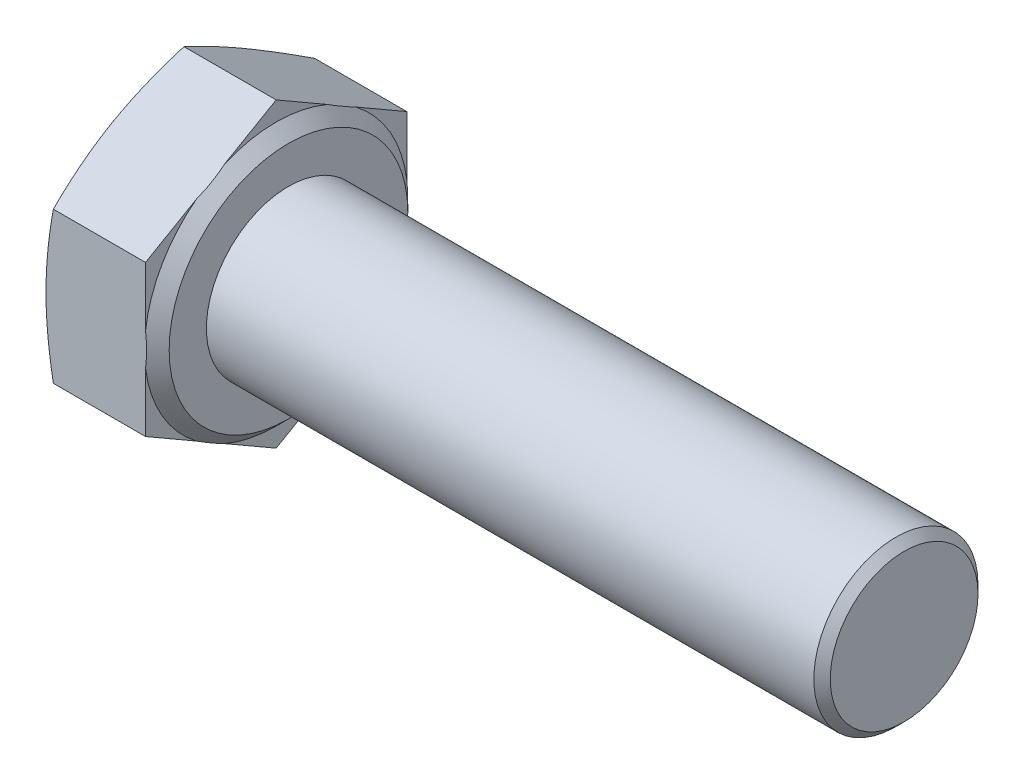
ISO-10303-21;
HEADER;
FILE_DESCRIPTION(('STEP AP214'),'2;1');
FILE_NAME('part.step','',(''),(''),'','','');
FILE_SCHEMA(('AUTOMOTIVE_DESIGN { 1 0 10303 214 1 1 1 1 }'));
ENDSEC;
DATA;
#1=APPLICATION_CONTEXT('core data for automotive mechanical design processes');
#2=APPLICATION_PROTOCOL_DEFINITION('international standard','automotive_design',2000,#1);
#3=PRODUCT_CONTEXT('',#1,'mechanical');
#4=PRODUCT('Part','Part','',(#3));
#5=PRODUCT_RELATED_PRODUCT_CATEGORY('part','',(#4));
#6=PRODUCT_DEFINITION_FORMATION('','',#4);
#7=PRODUCT_DEFINITION_CONTEXT('part definition',#1,'design');
#8=PRODUCT_DEFINITION('design','',#6,#7);
#9=PRODUCT_DEFINITION_SHAPE('','',#8);
#10=(LENGTH_UNIT() NAMED_UNIT(*) SI_UNIT(.MILLI.,.METRE.));
#11=(NAMED_UNIT(*) PLANE_ANGLE_UNIT() SI_UNIT($,.RADIAN.));
#12=(NAMED_UNIT(*) SI_UNIT($,.STERADIAN.) SOLID_ANGLE_UNIT());
#13=UNCERTAINTY_MEASURE_WITH_UNIT(LENGTH_MEASURE(1.E-05),#10,'distance_accuracy_value','');
#14=(GEOMETRIC_REPRESENTATION_CONTEXT(3) GLOBAL_UNCERTAINTY_ASSIGNED_CONTEXT((#13)) GLOBAL_UNIT_ASSIGNED_CONTEXT((#10,
#11,#12)) REPRESENTATION_CONTEXT('',''));
#15=CARTESIAN_POINT('',(0.,0.,0.));
#16=DIRECTION('',(0.,0.,1.));
#17=DIRECTION('',(1.,0.,0.));
#18=AXIS2_PLACEMENT_3D('',#15,#16,#17);
#19=CARTESIAN_POINT('',(5.45,-3.67483446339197,-6.365));
#20=DIRECTION('',(1.,0.,0.));
#21=DIRECTION('',(0.,0.,-1.));
#22=AXIS2_PLACEMENT_3D('',#19,#20,#21);
#23=PLANE('',#22);
#24=CARTESIAN_POINT('',(5.45,0.,0.));
#25=DIRECTION('',(-1.,0.,0.));
#26=DIRECTION('',(0.,0.,1.));
#27=AXIS2_PLACEMENT_3D('',#24,#25,#26);
#28=CIRCLE('',#27,5.815);
#29=CARTESIAN_POINT('',(5.45,0.,5.815));
#30=VERTEX_POINT('',#29);
#31=EDGE_CURVE('E344',#30,#30,#28,.T.);
#32=ORIENTED_EDGE('',*,*,#31,.F.);
#33=EDGE_LOOP('',(#32));
#34=FACE_BOUND('',#33,.T.);
#35=CARTESIAN_POINT('',(5.45,0.,0.));
#36=DIRECTION('',(1.,0.,0.));
#37=DIRECTION('',(0.,0.,-1.));
#38=AXIS2_PLACEMENT_3D('',#35,#36,#37);
#39=CIRCLE('',#38,4.);
#40=CARTESIAN_POINT('',(5.45,0.,-4.));
#41=VERTEX_POINT('',#40);
#42=EDGE_CURVE('E347',#41,#41,#39,.T.);
#43=ORIENTED_EDGE('',*,*,#42,.F.);
#44=EDGE_LOOP('',(#43));
#45=FACE_BOUND('',#44,.T.);
#46=ADVANCED_FACE('F32',(#34,#45),#23,.T.);
#47=CARTESIAN_POINT('',(5.45,-7.34966892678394,0.));
#48=DIRECTION('',(0.,0.866025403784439,0.5));
#49=DIRECTION('',(0.,-0.5,0.866025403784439));
#50=AXIS2_PLACEMENT_3D('',#47,#48,#49);
#51=PLANE('',#50);
#52=CARTESIAN_POINT('',(0.358432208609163,-3.67471899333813,-6.3652));
#53=CARTESIAN_POINT('',(0.303017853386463,-3.82691148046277,-6.10159487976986));
#54=CARTESIAN_POINT('',(0.252608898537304,-3.9796058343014,-5.83712050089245));
#55=CARTESIAN_POINT('',(0.163922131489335,-4.28598738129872,-5.30645209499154));
#56=CARTESIAN_POINT('',(0.125653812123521,-4.43967525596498,-5.0402568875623));
#57=CARTESIAN_POINT('',(0.0637558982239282,-4.74633825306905,-4.50910099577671));
#58=CARTESIAN_POINT('',(0.0399912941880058,-4.8993063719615,-4.24415244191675));
#59=CARTESIAN_POINT('',(0.00811628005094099,-5.2056003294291,-3.71363574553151));
#60=CARTESIAN_POINT('',(0.,-5.35892601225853,-3.44806787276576));
#61=CARTESIAN_POINT('',(0.,-5.66557737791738,-2.91693212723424));
#62=CARTESIAN_POINT('',(0.00811628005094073,-5.81890306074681,-2.65136425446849));
#63=CARTESIAN_POINT('',(0.0399912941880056,-6.12519701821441,-2.12084755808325));
#64=CARTESIAN_POINT('',(0.0637558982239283,-6.27816513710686,-1.85589900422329));
#65=CARTESIAN_POINT('',(0.125653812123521,-6.58482813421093,-1.3247431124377));
#66=CARTESIAN_POINT('',(0.163922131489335,-6.73851600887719,-1.05854790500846));
#67=CARTESIAN_POINT('',(0.252608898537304,-7.04489755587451,-0.527879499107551));
#68=CARTESIAN_POINT('',(0.303017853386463,-7.19759190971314,-0.263405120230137));
#69=CARTESIAN_POINT('',(0.358432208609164,-7.34978439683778,0.000200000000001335));
#70=B_SPLINE_CURVE_WITH_KNOTS('',3,(#52,#53,#54,#55,#56,#57,#58,#59,#60,#61,#62,#63,#64,#65,#66,
#67,#68,#69),.UNSPECIFIED.,.F.,.F.,(4,2,2,2,2,2,2,2,4),(0.,0.928259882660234,1.85724379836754,
2.77744274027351,3.69729643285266,4.6171501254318,5.53734906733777,6.46633298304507,
7.39459286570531),.UNSPECIFIED.);
#71=CARTESIAN_POINT('',(0.358390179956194,-3.67483446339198,-6.365));
#72=VERTEX_POINT('',#71);
#73=CARTESIAN_POINT('',(0.,-5.51225169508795,-3.1825));
#74=VERTEX_POINT('',#73);
#75=EDGE_CURVE('E146',#72,#74,#70,.T.);
#76=ORIENTED_EDGE('',*,*,#75,.F.);
#77=DIRECTION('',(-1.,0.,0.));
#78=VECTOR('',#77,1.);
#79=CARTESIAN_POINT('',(5.45,-3.67483446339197,-6.365));
#80=LINE('',#79,#78);
#81=CARTESIAN_POINT('',(4.85,-3.67483446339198,-6.365));
#82=VERTEX_POINT('',#81);
#83=EDGE_CURVE('E175',#82,#72,#80,.T.);
#84=ORIENTED_EDGE('',*,*,#83,.F.);
#85=DIRECTION('',(0.,0.5,-0.866025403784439));
#86=VECTOR('',#85,1.);
#87=CARTESIAN_POINT('',(4.85,-7.34966892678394,0.));
#88=LINE('',#87,#86);
#89=CARTESIAN_POINT('',(4.85,-5.11256431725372,-3.87477884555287));
#90=VERTEX_POINT('',#89);
#91=EDGE_CURVE('E384',#90,#82,#88,.T.);
#92=ORIENTED_EDGE('',*,*,#91,.F.);
#93=CARTESIAN_POINT('',(4.8498,-5.91274078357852,-2.48883255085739));
#94=CARTESIAN_POINT('',(4.86645104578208,-5.84620990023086,-2.60406742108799));
#95=CARTESIAN_POINT('',(4.8790176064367,-5.77941769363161,-2.71975491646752));
#96=CARTESIAN_POINT('',(4.8957758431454,-5.64583354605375,-2.95112944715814));
#97=CARTESIAN_POINT('',(4.9,-5.57904262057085,-3.06681472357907));
#98=CARTESIAN_POINT('',(4.9,-5.44546076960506,-3.29818527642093));
#99=CARTESIAN_POINT('',(4.8957758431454,-5.37866984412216,-3.41387055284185));
#100=CARTESIAN_POINT('',(4.8790176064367,-5.2450856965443,-3.64524508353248));
#101=CARTESIAN_POINT('',(4.86645104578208,-5.17829348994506,-3.76093257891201));
#102=CARTESIAN_POINT('',(4.8498,-5.11176260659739,-3.87616744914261));
#103=B_SPLINE_CURVE_WITH_KNOTS('',3,(#93,#94,#95,#96,#97,#98,#99,#100,#101,#102),.UNSPECIFIED.,
.F.,.F.,(4,2,2,2,4),(0.,0.402253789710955,0.802938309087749,1.20362282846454,1.6058766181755),.UNSPECIFIED.);
#104=CARTESIAN_POINT('',(4.85,-5.91193907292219,-2.49022115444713));
#105=VERTEX_POINT('',#104);
#106=EDGE_CURVE('E281',#105,#90,#103,.T.);
#107=ORIENTED_EDGE('',*,*,#106,.F.);
#108=CARTESIAN_POINT('',(4.85,-7.34966892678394,0.));
#109=VERTEX_POINT('',#108);
#110=EDGE_CURVE('E389',#109,#105,#88,.T.);
#111=ORIENTED_EDGE('',*,*,#110,.F.);
#112=DIRECTION('',(-1.,0.,0.));
#113=VECTOR('',#112,1.);
#114=CARTESIAN_POINT('',(5.45,-7.34966892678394,0.));
#115=LINE('',#114,#113);
#116=CARTESIAN_POINT('',(0.358390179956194,-7.34966892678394,0.));
#117=VERTEX_POINT('',#116);
#118=EDGE_CURVE('E169',#109,#117,#115,.T.);
#119=ORIENTED_EDGE('',*,*,#118,.T.);
#120=EDGE_CURVE('E200',#74,#117,#70,.T.);
#121=ORIENTED_EDGE('',*,*,#120,.F.);
#122=EDGE_LOOP('',(#76,#84,#92,#107,#111,#119,#121));
#123=FACE_BOUND('',#122,.T.);
#124=ADVANCED_FACE('F215',(#123),#51,.F.);
#125=CARTESIAN_POINT('',(5.45,-3.67483446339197,-6.365));
#126=DIRECTION('',(0.,0.,1.));
#127=DIRECTION('',(0.,-1.,0.));
#128=AXIS2_PLACEMENT_3D('',#125,#126,#127);
#129=PLANE('',#128);
#130=CARTESIAN_POINT('',(1.9150953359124,-9.72967062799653,-6.365));
#131=CARTESIAN_POINT('',(1.82740685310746,-9.44169496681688,-6.365));
#132=CARTESIAN_POINT('',(1.74074158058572,-9.15340194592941,-6.365));
#133=CARTESIAN_POINT('',(1.57002349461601,-8.57601961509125,-6.365));
#134=CARTESIAN_POINT('',(1.48597088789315,-8.28693024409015,-6.365));
#135=CARTESIAN_POINT('',(1.320904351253,-7.70729883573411,-6.365));
#136=CARTESIAN_POINT('',(1.23989638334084,-7.41675509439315,-6.365));
#137=CARTESIAN_POINT('',(1.08186750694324,-6.83458682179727,-6.365));
#138=CARTESIAN_POINT('',(1.0048465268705,-6.54296231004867,-6.365));
#139=CARTESIAN_POINT('',(0.856698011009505,-5.96204179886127,-6.365));
#140=CARTESIAN_POINT('',(0.785509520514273,-5.67276142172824,-6.365));
#141=CARTESIAN_POINT('',(0.64919338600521,-5.09276117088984,-6.365));
#142=CARTESIAN_POINT('',(0.584065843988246,-4.80204127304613,-6.365));
#143=CARTESIAN_POINT('',(0.46138999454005,-4.21909692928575,-6.365));
#144=CARTESIAN_POINT('',(0.40383910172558,-3.92687303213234,-6.365));
#145=CARTESIAN_POINT('',(0.298068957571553,-3.34072867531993,-6.365));
#146=CARTESIAN_POINT('',(0.249849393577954,-3.04680827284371,-6.365));
#147=CARTESIAN_POINT('',(0.169475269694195,-2.49036754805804,-6.365));
#148=CARTESIAN_POINT('',(0.136125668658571,-2.22802146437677,-6.365));
#149=CARTESIAN_POINT('',(0.0796727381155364,-1.70221996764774,-6.365));
#150=CARTESIAN_POINT('',(0.0565691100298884,-1.43876458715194,-6.365));
#151=CARTESIAN_POINT('',(0.0217207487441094,-0.911278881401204,-6.365));
#152=CARTESIAN_POINT('',(0.00996798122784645,-0.64724909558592,-6.365));
#153=CARTESIAN_POINT('',(-0.00158361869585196,-0.11892536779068,-6.365));
#154=CARTESIAN_POINT('',(-0.00138253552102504,0.145368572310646,-6.365));
#155=CARTESIAN_POINT('',(0.0109939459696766,0.675012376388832,-6.365));
#156=CARTESIAN_POINT('',(0.0232300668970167,0.940360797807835,-6.365));
#157=CARTESIAN_POINT('',(0.0591135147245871,1.47027824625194,-6.365));
#158=CARTESIAN_POINT('',(0.0827611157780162,1.73484725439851,-6.365));
#159=CARTESIAN_POINT('',(0.14036130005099,2.26307523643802,-6.365));
#160=CARTESIAN_POINT('',(0.174322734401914,2.52673323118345,-6.365));
#161=CARTESIAN_POINT('',(0.251173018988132,3.0527302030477,-6.365));
#162=CARTESIAN_POINT('',(0.294061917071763,3.31506917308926,-6.365));
#163=CARTESIAN_POINT('',(0.389839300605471,3.85223310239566,-6.365));
#164=CARTESIAN_POINT('',(0.443136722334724,4.12698449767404,-6.365));
#165=CARTESIAN_POINT('',(0.556591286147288,4.67507636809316,-6.365));
#166=CARTESIAN_POINT('',(0.616748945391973,4.94841673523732,-6.365));
#167=CARTESIAN_POINT('',(0.742660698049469,5.49388136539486,-6.365));
#168=CARTESIAN_POINT('',(0.808416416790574,5.7660052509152,-6.365));
#169=CARTESIAN_POINT('',(0.944454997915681,6.30910658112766,-6.365));
#170=CARTESIAN_POINT('',(1.01473775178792,6.58008405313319,-6.365));
#171=CARTESIAN_POINT('',(1.15907513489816,7.1214003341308,-6.365));
#172=CARTESIAN_POINT('',(1.23313447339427,7.39173788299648,-6.365));
#173=CARTESIAN_POINT('',(1.38427063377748,7.93156975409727,-6.365));
#174=CARTESIAN_POINT('',(1.46134750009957,8.20106406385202,-6.365));
#175=CARTESIAN_POINT('',(1.69623888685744,9.00837522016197,-6.365));
#176=CARTESIAN_POINT('',(1.85774082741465,9.5451184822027,-6.365));
#177=CARTESIAN_POINT('',(2.18566531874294,10.6106004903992,-6.365));
#178=CARTESIAN_POINT('',(2.35201388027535,11.1393621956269,-6.365));
#179=CARTESIAN_POINT('',(2.68943698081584,12.1954003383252,-6.365));
#180=CARTESIAN_POINT('',(2.86051174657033,12.7226767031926,-6.365));
#181=CARTESIAN_POINT('',(3.20545948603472,13.7740950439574,-6.365));
#182=CARTESIAN_POINT('',(3.37931937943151,14.298241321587,-6.365));
#183=CARTESIAN_POINT('',(3.64203864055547,15.0837906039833,-6.365));
#184=CARTESIAN_POINT('',(3.72992971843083,15.3455181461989,-6.365));
#185=CARTESIAN_POINT('',(3.90628058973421,15.8687808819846,-6.365));
#186=CARTESIAN_POINT('',(3.99474038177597,16.1303160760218,-6.365));
#187=CARTESIAN_POINT('',(4.08344640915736,16.3917677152,-6.365));
#188=B_SPLINE_CURVE_WITH_KNOTS('',3,(#130,#131,#132,#133,#134,#135,#136,#137,#138,#139,#140,
#141,#142,#143,#144,#145,#146,#147,#148,#149,#150,#151,#152,#153,#154,#155,#156,#157,#158,#159,
#160,#161,#162,#163,#164,#165,#166,#167,#168,#169,#170,#171,#172,#173,#174,#175,#176,#177,#178,
#179,#180,#181,#182,#183,#184,#185,#186,#187),.UNSPECIFIED.,.F.,.F.,(4,2,2,2,2,2,2,2,2,2,2,2,2,
2,2,2,2,2,2,2,2,2,2,2,2,2,2,2,4),(0.,0.903097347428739,1.8062659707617,2.7111196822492,
3.61595714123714,4.50963841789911,5.4033347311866,6.29672529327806,7.19008591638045,
7.98328363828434,8.77645824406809,9.56907101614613,10.361678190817,11.1583050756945,
11.9549510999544,12.7522827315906,13.5496186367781,14.3891305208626,15.2287057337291,
16.0685255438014,16.9083252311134,17.7491990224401,18.5900852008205,20.271552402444,
21.9344598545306,23.5974472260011,25.2541246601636,26.0823966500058,26.9106666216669),.UNSPECIFIED.);
#189=CARTESIAN_POINT('',(0.358390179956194,3.67483446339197,-6.36500000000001));
#190=VERTEX_POINT('',#189);
#191=CARTESIAN_POINT('',(0.,0.,-6.365));
#192=VERTEX_POINT('',#191);
#193=EDGE_CURVE('E260',#190,#192,#188,.F.);
#194=ORIENTED_EDGE('',*,*,#193,.F.);
#195=DIRECTION('',(-1.,0.,0.));
#196=VECTOR('',#195,1.);
#197=CARTESIAN_POINT('',(5.45,3.67483446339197,-6.365));
#198=LINE('',#197,#196);
#199=CARTESIAN_POINT('',(4.85,3.67483446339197,-6.365));
#200=VERTEX_POINT('',#199);
#201=EDGE_CURVE('E166',#200,#190,#198,.T.);
#202=ORIENTED_EDGE('',*,*,#201,.F.);
#203=DIRECTION('',(0.,1.,0.));
#204=VECTOR('',#203,1.);
#205=CARTESIAN_POINT('',(4.85,-3.67483446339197,-6.365));
#206=LINE('',#205,#204);
#207=CARTESIAN_POINT('',(4.85,0.7993747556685,-6.365));
#208=VERTEX_POINT('',#207);
#209=EDGE_CURVE('E390',#208,#200,#206,.T.);
#210=ORIENTED_EDGE('',*,*,#209,.F.);
#211=CARTESIAN_POINT('',(4.03279951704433,-3.43387519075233,-6.365));
#212=CARTESIAN_POINT('',(4.12915263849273,-3.23085023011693,-6.365));
#213=CARTESIAN_POINT('',(4.22025748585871,-3.02511909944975,-6.365));
#214=CARTESIAN_POINT('',(4.38924442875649,-2.607586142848,-6.365));
#215=CARTESIAN_POINT('',(4.46708471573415,-2.39576749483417,-6.365));
#216=CARTESIAN_POINT('',(4.60570873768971,-1.96811964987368,-6.365));
#217=CARTESIAN_POINT('',(4.66660505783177,-1.75232760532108,-6.365));
#218=CARTESIAN_POINT('',(4.76875528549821,-1.31633465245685,-6.365));
#219=CARTESIAN_POINT('',(4.81003455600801,-1.09613982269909,-6.365));
#220=CARTESIAN_POINT('',(4.86166598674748,-0.716857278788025,-6.365));
#221=CARTESIAN_POINT('',(4.87750915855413,-0.558507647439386,-6.365));
#222=CARTESIAN_POINT('',(4.89740688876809,-0.241033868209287,-6.365));
#223=CARTESIAN_POINT('',(4.90146005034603,-0.0819096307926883,-6.365));
#224=CARTESIAN_POINT('',(4.89760366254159,0.236307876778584,-6.365));
#225=CARTESIAN_POINT('',(4.8896854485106,0.395401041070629,-6.365));
#226=CARTESIAN_POINT('',(4.86219166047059,0.712536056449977,-6.365));
#227=CARTESIAN_POINT('',(4.84261749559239,0.870578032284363,-6.365));
#228=CARTESIAN_POINT('',(4.77989629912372,1.26397857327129,-6.365));
#229=CARTESIAN_POINT('',(4.72984501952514,1.49825109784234,-6.365));
#230=CARTESIAN_POINT('',(4.60840439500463,1.96142866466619,-6.365));
#231=CARTESIAN_POINT('',(4.53698240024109,2.19032491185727,-6.365));
#232=CARTESIAN_POINT('',(4.37639278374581,2.64284924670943,-6.365));
#233=CARTESIAN_POINT('',(4.28714977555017,2.86645027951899,-6.365));
#234=CARTESIAN_POINT('',(4.14298757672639,3.1968115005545,-6.365));
#235=CARTESIAN_POINT('',(4.09331043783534,3.30591051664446,-6.365));
#236=CARTESIAN_POINT('',(3.99087238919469,3.52261302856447,-6.365));
#237=CARTESIAN_POINT('',(3.93811240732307,3.63021696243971,-6.365));
#238=CARTESIAN_POINT('',(3.88398571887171,3.73713082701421,-6.365));
#239=B_SPLINE_CURVE_WITH_KNOTS('',3,(#211,#212,#213,#214,#215,#216,#217,#218,#219,#220,#221,
#222,#223,#224,#225,#226,#227,#228,#229,#230,#231,#232,#233,#234,#235,#236,#237,#238),
.UNSPECIFIED.,.F.,.F.,(4,2,2,2,2,2,2,2,2,2,2,2,2,4),(0.,0.67440515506,1.35089815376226,
2.02278254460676,2.69379587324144,3.17081389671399,3.64788843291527,4.1253084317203,
4.60267072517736,5.32008921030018,6.03860940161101,6.76023604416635,7.11982798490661,
7.47931224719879),.UNSPECIFIED.);
#240=CARTESIAN_POINT('',(4.85,-0.799374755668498,-6.365));
#241=VERTEX_POINT('',#240);
#242=EDGE_CURVE('E275',#241,#208,#239,.T.);
#243=ORIENTED_EDGE('',*,*,#242,.F.);
#244=EDGE_CURVE('E386',#82,#241,#206,.T.);
#245=ORIENTED_EDGE('',*,*,#244,.F.);
#246=ORIENTED_EDGE('',*,*,#83,.T.);
#247=EDGE_CURVE('E157',#192,#72,#188,.F.);
#248=ORIENTED_EDGE('',*,*,#247,.F.);
#249=EDGE_LOOP('',(#194,#202,#210,#243,#245,#246,#248));
#250=FACE_BOUND('',#249,.T.);
#251=ADVANCED_FACE('F267',(#250),#129,.F.);
#252=CARTESIAN_POINT('',(5.45,3.67483446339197,-6.365));
#253=DIRECTION('',(0.,-0.866025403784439,0.5));
#254=DIRECTION('',(0.,-0.5,-0.866025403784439));
#255=AXIS2_PLACEMENT_3D('',#252,#253,#254);
#256=PLANE('',#255);
#257=CARTESIAN_POINT('',(0.358432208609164,7.34978439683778,0.000200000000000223));
#258=CARTESIAN_POINT('',(0.303017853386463,7.19759190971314,-0.263405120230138));
#259=CARTESIAN_POINT('',(0.252608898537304,7.04489755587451,-0.527879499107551));
#260=CARTESIAN_POINT('',(0.163922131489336,6.73851600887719,-1.05854790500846));
#261=CARTESIAN_POINT('',(0.125653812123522,6.58482813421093,-1.3247431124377));
#262=CARTESIAN_POINT('',(0.0637558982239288,6.27816513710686,-1.85589900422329));
#263=CARTESIAN_POINT('',(0.0399912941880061,6.12519701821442,-2.12084755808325));
#264=CARTESIAN_POINT('',(0.00811628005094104,5.81890306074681,-2.65136425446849));
#265=CARTESIAN_POINT('',(0.,5.66557737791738,-2.91693212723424));
#266=CARTESIAN_POINT('',(0.,5.35892601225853,-3.44806787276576));
#267=CARTESIAN_POINT('',(0.00811628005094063,5.2056003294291,-3.71363574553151));
#268=CARTESIAN_POINT('',(0.0399912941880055,4.8993063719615,-4.24415244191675));
#269=CARTESIAN_POINT('',(0.0637558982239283,4.74633825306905,-4.50910099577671));
#270=CARTESIAN_POINT('',(0.125653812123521,4.43967525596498,-5.0402568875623));
#271=CARTESIAN_POINT('',(0.163922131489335,4.28598738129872,-5.30645209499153));
#272=CARTESIAN_POINT('',(0.252608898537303,3.9796058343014,-5.83712050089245));
#273=CARTESIAN_POINT('',(0.303017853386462,3.82691148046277,-6.10159487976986));
#274=CARTESIAN_POINT('',(0.358432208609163,3.67471899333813,-6.3652));
#275=B_SPLINE_CURVE_WITH_KNOTS('',3,(#257,#258,#259,#260,#261,#262,#263,#264,#265,#266,#267,
#268,#269,#270,#271,#272,#273,#274),.UNSPECIFIED.,.F.,.F.,(4,2,2,2,2,2,2,2,4),(0.,
0.928259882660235,1.85724379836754,2.77744274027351,3.69729643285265,4.6171501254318,
5.53734906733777,6.46633298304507,7.39459286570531),.UNSPECIFIED.);
#276=CARTESIAN_POINT('',(0.358390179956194,7.34966892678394,0.));
#277=VERTEX_POINT('',#276);
#278=CARTESIAN_POINT('',(0.,5.51225169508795,-3.1825));
#279=VERTEX_POINT('',#278);
#280=EDGE_CURVE('E47',#277,#279,#275,.T.);
#281=ORIENTED_EDGE('',*,*,#280,.F.);
#282=DIRECTION('',(-1.,0.,0.));
#283=VECTOR('',#282,1.);
#284=CARTESIAN_POINT('',(5.45,7.34966892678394,0.));
#285=LINE('',#284,#283);
#286=CARTESIAN_POINT('',(4.85,7.34966892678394,0.));
#287=VERTEX_POINT('',#286);
#288=EDGE_CURVE('E163',#287,#277,#285,.T.);
#289=ORIENTED_EDGE('',*,*,#288,.F.);
#290=DIRECTION('',(0.,0.5,0.866025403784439));
#291=VECTOR('',#290,1.);
#292=CARTESIAN_POINT('',(4.85,3.67483446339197,-6.365));
#293=LINE('',#292,#291);
#294=CARTESIAN_POINT('',(4.85,5.91193907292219,-2.49022115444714));
#295=VERTEX_POINT('',#294);
#296=EDGE_CURVE('E414',#295,#287,#293,.T.);
#297=ORIENTED_EDGE('',*,*,#296,.F.);
#298=CARTESIAN_POINT('',(4.8498,5.11176260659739,-3.87616744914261));
#299=CARTESIAN_POINT('',(4.86645104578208,5.17829348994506,-3.76093257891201));
#300=CARTESIAN_POINT('',(4.8790176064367,5.2450856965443,-3.64524508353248));
#301=CARTESIAN_POINT('',(4.8957758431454,5.37866984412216,-3.41387055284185));
#302=CARTESIAN_POINT('',(4.9,5.44546076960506,-3.29818527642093));
#303=CARTESIAN_POINT('',(4.9,5.57904262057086,-3.06681472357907));
#304=CARTESIAN_POINT('',(4.8957758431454,5.64583354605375,-2.95112944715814));
#305=CARTESIAN_POINT('',(4.8790176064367,5.77941769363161,-2.71975491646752));
#306=CARTESIAN_POINT('',(4.86645104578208,5.84620990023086,-2.60406742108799));
#307=CARTESIAN_POINT('',(4.8498,5.91274078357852,-2.48883255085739));
#308=B_SPLINE_CURVE_WITH_KNOTS('',3,(#298,#299,#300,#301,#302,#303,#304,#305,#306,#307),
.UNSPECIFIED.,.F.,.F.,(4,2,2,2,4),(0.,0.402253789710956,0.80293830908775,1.20362282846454,
1.6058766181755),.UNSPECIFIED.);
#309=CARTESIAN_POINT('',(4.85,5.11256431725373,-3.87477884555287));
#310=VERTEX_POINT('',#309);
#311=EDGE_CURVE('E282',#310,#295,#308,.T.);
#312=ORIENTED_EDGE('',*,*,#311,.F.);
#313=EDGE_CURVE('E409',#200,#310,#293,.T.);
#314=ORIENTED_EDGE('',*,*,#313,.F.);
#315=ORIENTED_EDGE('',*,*,#201,.T.);
#316=EDGE_CURVE('E261',#279,#190,#275,.T.);
#317=ORIENTED_EDGE('',*,*,#316,.F.);
#318=EDGE_LOOP('',(#281,#289,#297,#312,#314,#315,#317));
#319=FACE_BOUND('',#318,.T.);
#320=ADVANCED_FACE('F270',(#319),#256,.F.);
#321=CARTESIAN_POINT('',(5.45,7.34966892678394,0.));
#322=DIRECTION('',(0.,-0.866025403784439,-0.5));
#323=DIRECTION('',(0.,0.5,-0.866025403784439));
#324=AXIS2_PLACEMENT_3D('',#321,#322,#323);
#325=PLANE('',#324);
#326=CARTESIAN_POINT('',(0.358432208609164,3.67471899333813,6.3652));
#327=CARTESIAN_POINT('',(0.303017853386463,3.82691148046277,6.10159487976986));
#328=CARTESIAN_POINT('',(0.252608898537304,3.9796058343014,5.83712050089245));
#329=CARTESIAN_POINT('',(0.163922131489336,4.28598738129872,5.30645209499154));
#330=CARTESIAN_POINT('',(0.125653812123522,4.43967525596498,5.0402568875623));
#331=CARTESIAN_POINT('',(0.0637558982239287,4.74633825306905,4.50910099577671));
#332=CARTESIAN_POINT('',(0.0399912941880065,4.8993063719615,4.24415244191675));
#333=CARTESIAN_POINT('',(0.00811628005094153,5.2056003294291,3.71363574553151));
#334=CARTESIAN_POINT('',(0.,5.35892601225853,3.44806787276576));
#335=CARTESIAN_POINT('',(0.,5.66557737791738,2.91693212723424));
#336=CARTESIAN_POINT('',(0.0081162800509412,5.81890306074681,2.65136425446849));
#337=CARTESIAN_POINT('',(0.0399912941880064,6.12519701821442,2.12084755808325));
#338=CARTESIAN_POINT('',(0.0637558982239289,6.27816513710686,1.85589900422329));
#339=CARTESIAN_POINT('',(0.125653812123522,6.58482813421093,1.3247431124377));
#340=CARTESIAN_POINT('',(0.163922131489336,6.73851600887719,1.05854790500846));
#341=CARTESIAN_POINT('',(0.252608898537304,7.04489755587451,0.527879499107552));
#342=CARTESIAN_POINT('',(0.303017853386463,7.19759190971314,0.263405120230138));
#343=CARTESIAN_POINT('',(0.358432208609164,7.34978439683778,-0.00020000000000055));
#344=B_SPLINE_CURVE_WITH_KNOTS('',3,(#326,#327,#328,#329,#330,#331,#332,#333,#334,#335,#336,
#337,#338,#339,#340,#341,#342,#343),.UNSPECIFIED.,.F.,.F.,(4,2,2,2,2,2,2,2,4),(0.,
0.928259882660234,1.85724379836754,2.77744274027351,3.69729643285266,4.6171501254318,
5.53734906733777,6.46633298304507,7.39459286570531),.UNSPECIFIED.);
#345=CARTESIAN_POINT('',(0.358390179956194,3.67483446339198,6.365));
#346=VERTEX_POINT('',#345);
#347=CARTESIAN_POINT('',(0.,5.51225169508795,3.1825));
#348=VERTEX_POINT('',#347);
#349=EDGE_CURVE('E55',#346,#348,#344,.T.);
#350=ORIENTED_EDGE('',*,*,#349,.F.);
#351=DIRECTION('',(-1.,0.,0.));
#352=VECTOR('',#351,1.);
#353=CARTESIAN_POINT('',(5.45,3.67483446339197,6.365));
#354=LINE('',#353,#352);
#355=CARTESIAN_POINT('',(4.85,3.67483446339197,6.365));
#356=VERTEX_POINT('',#355);
#357=EDGE_CURVE('E154',#356,#346,#354,.T.);
#358=ORIENTED_EDGE('',*,*,#357,.F.);
#359=DIRECTION('',(0.,-0.5,0.866025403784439));
#360=VECTOR('',#359,1.);
#361=CARTESIAN_POINT('',(4.85,7.34966892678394,0.));
#362=LINE('',#361,#360);
#363=CARTESIAN_POINT('',(4.85,5.11256431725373,3.87477884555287));
#364=VERTEX_POINT('',#363);
#365=EDGE_CURVE('E421',#364,#356,#362,.T.);
#366=ORIENTED_EDGE('',*,*,#365,.F.);
#367=CARTESIAN_POINT('',(4.8498,5.91274078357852,2.48883255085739));
#368=CARTESIAN_POINT('',(4.86645104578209,5.84620990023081,2.60406742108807));
#369=CARTESIAN_POINT('',(4.87901760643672,5.77941769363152,2.71975491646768));
#370=CARTESIAN_POINT('',(4.89577584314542,5.64583354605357,2.95112944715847));
#371=CARTESIAN_POINT('',(4.90000000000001,5.57904262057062,3.06681472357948));
#372=CARTESIAN_POINT('',(4.89999999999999,5.44546076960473,3.29818527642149));
#373=CARTESIAN_POINT('',(4.89577584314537,5.37866984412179,3.4138705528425));
#374=CARTESIAN_POINT('',(4.87901760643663,5.24508569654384,3.64524508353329));
#375=CARTESIAN_POINT('',(4.86645104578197,5.17829348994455,3.7609325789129));
#376=CARTESIAN_POINT('',(4.84979999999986,5.11176260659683,3.87616744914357));
#377=B_SPLINE_CURVE_WITH_KNOTS('',3,(#367,#368,#369,#370,#371,#372,#373,#374,#375,#376),
.UNSPECIFIED.,.F.,.F.,(4,2,2,2,4),(0.,0.402253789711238,0.802938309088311,1.20362282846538,
1.60587661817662),.UNSPECIFIED.);
#378=CARTESIAN_POINT('',(4.85,5.91193907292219,2.49022115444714));
#379=VERTEX_POINT('',#378);
#380=EDGE_CURVE('E314',#379,#364,#377,.T.);
#381=ORIENTED_EDGE('',*,*,#380,.F.);
#382=EDGE_CURVE('E420',#287,#379,#362,.T.);
#383=ORIENTED_EDGE('',*,*,#382,.F.);
#384=ORIENTED_EDGE('',*,*,#288,.T.);
#385=EDGE_CURVE('E156',#348,#277,#344,.T.);
#386=ORIENTED_EDGE('',*,*,#385,.F.);
#387=EDGE_LOOP('',(#350,#358,#366,#381,#383,#384,#386));
#388=FACE_BOUND('',#387,.T.);
#389=ADVANCED_FACE('F152',(#388),#325,.F.);
#390=CARTESIAN_POINT('',(5.45,3.67483446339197,6.365));
#391=DIRECTION('',(0.,0.,-1.));
#392=DIRECTION('',(-1.,0.,0.));
#393=AXIS2_PLACEMENT_3D('',#390,#391,#392);
#394=PLANE('',#393);
#395=CARTESIAN_POINT('',(1.91509499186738,-9.72966949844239,6.365));
#396=CARTESIAN_POINT('',(1.8274065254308,-9.44169388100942,6.365));
#397=CARTESIAN_POINT('',(1.74074126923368,-9.15340090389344,6.365));
#398=CARTESIAN_POINT('',(1.57002321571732,-8.57601866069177,6.365));
#399=CARTESIAN_POINT('',(1.48597062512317,-8.28692933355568,6.365));
#400=CARTESIAN_POINT('',(1.32090412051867,-7.70729801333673,6.365));
#401=CARTESIAN_POINT('',(1.23989616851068,-7.41675431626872,6.365));
#402=CARTESIAN_POINT('',(1.08186732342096,-6.83458613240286,6.365));
#403=CARTESIAN_POINT('',(1.00484635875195,-6.54296166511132,6.365));
#404=CARTESIAN_POINT('',(0.856697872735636,-5.96204124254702,6.365));
#405=CARTESIAN_POINT('',(0.785509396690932,-5.67276090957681,6.365));
#406=CARTESIAN_POINT('',(0.64919328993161,-5.09276074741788,6.365));
#407=CARTESIAN_POINT('',(0.584065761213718,-4.80204089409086,6.365));
#408=CARTESIAN_POINT('',(0.461389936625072,-4.21909663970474,6.365));
#409=CARTESIAN_POINT('',(0.403839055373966,-3.92687278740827,6.365));
#410=CARTESIAN_POINT('',(0.2980689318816,-3.34072852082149,6.365));
#411=CARTESIAN_POINT('',(0.249849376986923,-3.04680816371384,6.365));
#412=CARTESIAN_POINT('',(0.169475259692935,-2.49036747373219,6.365));
#413=CARTESIAN_POINT('',(0.136125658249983,-2.22802137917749,6.365));
#414=CARTESIAN_POINT('',(0.0796727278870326,-1.7022198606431,6.365));
#415=CARTESIAN_POINT('',(0.0565691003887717,-1.43876446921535,6.365));
#416=CARTESIAN_POINT('',(0.021720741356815,-0.911278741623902,6.365));
#417=CARTESIAN_POINT('',(0.00996797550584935,-0.647248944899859,6.365));
#418=CARTESIAN_POINT('',(-0.00158362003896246,-0.118925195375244,6.365));
#419=CARTESIAN_POINT('',(-0.00138253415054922,0.145368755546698,6.365));
#420=CARTESIAN_POINT('',(0.0109939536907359,0.675012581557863,6.365));
#421=CARTESIAN_POINT('',(0.0232300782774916,0.940361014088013,6.365));
#422=CARTESIAN_POINT('',(0.05911353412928,1.4702784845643,6.365));
#423=CARTESIAN_POINT('',(0.0827611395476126,1.7348475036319,6.365));
#424=CARTESIAN_POINT('',(0.140361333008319,2.26307550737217,6.365));
#425=CARTESIAN_POINT('',(0.174322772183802,2.52673351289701,6.365));
#426=CARTESIAN_POINT('',(0.251173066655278,3.05273050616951,6.365));
#427=CARTESIAN_POINT('',(0.294061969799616,3.3150694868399,6.365));
#428=CARTESIAN_POINT('',(0.389839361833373,3.85223342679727,6.365));
#429=CARTESIAN_POINT('',(0.443136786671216,4.1269848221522,6.365));
#430=CARTESIAN_POINT('',(0.556591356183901,4.6750766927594,6.365));
#431=CARTESIAN_POINT('',(0.616749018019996,4.94841706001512,6.365));
#432=CARTESIAN_POINT('',(0.742660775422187,5.49388169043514,6.365));
#433=CARTESIAN_POINT('',(0.808416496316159,5.76600557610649,6.365));
#434=CARTESIAN_POINT('',(0.944455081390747,6.30910690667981,6.365));
#435=CARTESIAN_POINT('',(1.01473783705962,6.58008437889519,6.365));
#436=CARTESIAN_POINT('',(1.15907522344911,7.12140066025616,6.365));
#437=CARTESIAN_POINT('',(1.23313456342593,7.39173820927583,6.365));
#438=CARTESIAN_POINT('',(1.38427072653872,7.93157008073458,6.365));
#439=CARTESIAN_POINT('',(1.46134759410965,8.20106439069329,6.365));
#440=CARTESIAN_POINT('',(1.6962389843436,9.00837554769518,6.365));
#441=CARTESIAN_POINT('',(1.85774092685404,9.54511881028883,6.365));
#442=CARTESIAN_POINT('',(2.18566542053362,10.6106008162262,6.365));
#443=CARTESIAN_POINT('',(2.35201398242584,11.1393625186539,6.365));
#444=CARTESIAN_POINT('',(2.6894370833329,12.1954006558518,6.365));
#445=CARTESIAN_POINT('',(2.86051184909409,12.7226770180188,6.365));
#446=CARTESIAN_POINT('',(3.2054595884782,13.7740953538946,6.365));
#447=CARTESIAN_POINT('',(3.37931948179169,14.2982416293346,6.365));
#448=CARTESIAN_POINT('',(3.64203874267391,15.0837909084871,6.365));
#449=CARTESIAN_POINT('',(3.72992982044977,15.3455184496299,6.365));
#450=CARTESIAN_POINT('',(3.90628069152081,15.8687811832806,6.365));
#451=CARTESIAN_POINT('',(3.99474048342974,16.1303163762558,6.365));
#452=CARTESIAN_POINT('',(4.08344651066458,16.3917680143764,6.365));
#453=B_SPLINE_CURVE_WITH_KNOTS('',3,(#395,#396,#397,#398,#399,#400,#401,#402,#403,#404,#405,
#406,#407,#408,#409,#410,#411,#412,#413,#414,#415,#416,#417,#418,#419,#420,#421,#422,#423,#424,
#425,#426,#427,#428,#429,#430,#431,#432,#433,#434,#435,#436,#437,#438,#439,#440,#441,#442,#443,
#444,#445,#446,#447,#448,#449,#450,#451,#452),.UNSPECIFIED.,.F.,.F.,(4,2,2,2,2,2,2,2,2,2,2,2,2,
2,2,2,2,2,2,2,2,2,2,2,2,2,2,2,4),(0.,0.903097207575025,1.80626569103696,2.71111926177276,
3.61595658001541,4.50963771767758,5.40333389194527,6.29672431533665,7.19008479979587,
7.98328255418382,8.77645719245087,9.56906999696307,10.3616772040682,11.1583041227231,
11.9549501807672,12.7522818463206,13.5496177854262,14.3891296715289,15.2287048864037,
16.0685246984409,16.9083243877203,17.7491981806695,18.5900843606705,20.2715515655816,
21.9344590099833,23.5974463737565,25.2541238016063,26.0823957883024,26.9106657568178),.UNSPECIFIED.);
#454=CARTESIAN_POINT('',(0.358390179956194,-3.67483446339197,6.36500000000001));
#455=VERTEX_POINT('',#454);
#456=CARTESIAN_POINT('',(0.,0.,6.365));
#457=VERTEX_POINT('',#456);
#458=EDGE_CURVE('E148',#455,#457,#453,.T.);
#459=ORIENTED_EDGE('',*,*,#458,.F.);
#460=DIRECTION('',(-1.,0.,0.));
#461=VECTOR('',#460,1.);
#462=CARTESIAN_POINT('',(5.45,-3.67483446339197,6.365));
#463=LINE('',#462,#461);
#464=CARTESIAN_POINT('',(4.85,-3.67483446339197,6.36500000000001));
#465=VERTEX_POINT('',#464);
#466=EDGE_CURVE('E164',#465,#455,#463,.T.);
#467=ORIENTED_EDGE('',*,*,#466,.F.);
#468=DIRECTION('',(0.,-1.,0.));
#469=VECTOR('',#468,1.);
#470=CARTESIAN_POINT('',(4.85,3.67483446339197,6.365));
#471=LINE('',#470,#469);
#472=CARTESIAN_POINT('',(4.85,-0.799374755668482,6.365));
#473=VERTEX_POINT('',#472);
#474=EDGE_CURVE('E361',#473,#465,#471,.T.);
#475=ORIENTED_EDGE('',*,*,#474,.F.);
#476=CARTESIAN_POINT('',(4.03279951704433,-3.43387519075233,6.365));
#477=CARTESIAN_POINT('',(4.12915263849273,-3.23085023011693,6.365));
#478=CARTESIAN_POINT('',(4.22025748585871,-3.02511909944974,6.365));
#479=CARTESIAN_POINT('',(4.38924442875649,-2.607586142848,6.365));
#480=CARTESIAN_POINT('',(4.46708471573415,-2.39576749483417,6.365));
#481=CARTESIAN_POINT('',(4.60570873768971,-1.96811964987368,6.365));
#482=CARTESIAN_POINT('',(4.66660505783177,-1.75232760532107,6.365));
#483=CARTESIAN_POINT('',(4.76875528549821,-1.31633465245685,6.365));
#484=CARTESIAN_POINT('',(4.81003455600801,-1.09613982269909,6.365));
#485=CARTESIAN_POINT('',(4.86166598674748,-0.716857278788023,6.365));
#486=CARTESIAN_POINT('',(4.87750915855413,-0.558507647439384,6.365));
#487=CARTESIAN_POINT('',(4.89740688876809,-0.241033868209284,6.365));
#488=CARTESIAN_POINT('',(4.90146005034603,-0.0819096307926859,6.365));
#489=CARTESIAN_POINT('',(4.89760366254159,0.236307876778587,6.365));
#490=CARTESIAN_POINT('',(4.8896854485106,0.395401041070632,6.365));
#491=CARTESIAN_POINT('',(4.86219166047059,0.712536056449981,6.365));
#492=CARTESIAN_POINT('',(4.84261749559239,0.870578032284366,6.365));
#493=CARTESIAN_POINT('',(4.77989629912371,1.26397857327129,6.365));
#494=CARTESIAN_POINT('',(4.72984501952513,1.49825109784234,6.365));
#495=CARTESIAN_POINT('',(4.60840439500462,1.9614286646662,6.365));
#496=CARTESIAN_POINT('',(4.53698240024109,2.19032491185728,6.365));
#497=CARTESIAN_POINT('',(4.37639278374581,2.64284924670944,6.365));
#498=CARTESIAN_POINT('',(4.28714977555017,2.866450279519,6.365));
#499=CARTESIAN_POINT('',(4.14298757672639,3.1968115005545,6.365));
#500=CARTESIAN_POINT('',(4.09331043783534,3.30591051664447,6.365));
#501=CARTESIAN_POINT('',(3.99087238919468,3.52261302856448,6.365));
#502=CARTESIAN_POINT('',(3.93811240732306,3.63021696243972,6.365));
#503=CARTESIAN_POINT('',(3.88398571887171,3.73713082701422,6.365));
#504=B_SPLINE_CURVE_WITH_KNOTS('',3,(#476,#477,#478,#479,#480,#481,#482,#483,#484,#485,#486,
#487,#488,#489,#490,#491,#492,#493,#494,#495,#496,#497,#498,#499,#500,#501,#502,#503),
.UNSPECIFIED.,.F.,.F.,(4,2,2,2,2,2,2,2,2,2,2,2,2,4),(0.,0.67440515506,1.35089815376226,
2.02278254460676,2.69379587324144,3.17081389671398,3.64788843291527,4.1253084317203,
4.60267072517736,5.32008921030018,6.03860940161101,6.76023604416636,7.11982798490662,
7.47931224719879),.UNSPECIFIED.);
#505=CARTESIAN_POINT('',(4.85,0.799374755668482,6.365));
#506=VERTEX_POINT('',#505);
#507=EDGE_CURVE('E309',#506,#473,#504,.F.);
#508=ORIENTED_EDGE('',*,*,#507,.F.);
#509=EDGE_CURVE('E162',#356,#506,#471,.T.);
#510=ORIENTED_EDGE('',*,*,#509,.F.);
#511=ORIENTED_EDGE('',*,*,#357,.T.);
#512=EDGE_CURVE('E138',#457,#346,#453,.T.);
#513=ORIENTED_EDGE('',*,*,#512,.F.);
#514=EDGE_LOOP('',(#459,#467,#475,#508,#510,#511,#513));
#515=FACE_BOUND('',#514,.T.);
#516=ADVANCED_FACE('F160',(#515),#394,.F.);
#517=CARTESIAN_POINT('',(5.45,-3.67483446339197,6.365));
#518=DIRECTION('',(0.,0.866025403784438,-0.5));
#519=DIRECTION('',(0.,0.5,0.866025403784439));
#520=AXIS2_PLACEMENT_3D('',#517,#518,#519);
#521=PLANE('',#520);
#522=CARTESIAN_POINT('',(0.358432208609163,-7.34978439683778,-0.00019999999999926));
#523=CARTESIAN_POINT('',(0.303017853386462,-7.19759190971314,0.263405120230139));
#524=CARTESIAN_POINT('',(0.252608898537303,-7.04489755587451,0.527879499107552));
#525=CARTESIAN_POINT('',(0.163922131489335,-6.73851600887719,1.05854790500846));
#526=CARTESIAN_POINT('',(0.125653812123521,-6.58482813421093,1.3247431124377));
#527=CARTESIAN_POINT('',(0.0637558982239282,-6.27816513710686,1.85589900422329));
#528=CARTESIAN_POINT('',(0.0399912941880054,-6.12519701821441,2.12084755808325));
#529=CARTESIAN_POINT('',(0.00811628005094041,-5.81890306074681,2.65136425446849));
#530=CARTESIAN_POINT('',(0.,-5.66557737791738,2.91693212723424));
#531=CARTESIAN_POINT('',(0.,-5.35892601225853,3.44806787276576));
#532=CARTESIAN_POINT('',(0.00811628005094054,-5.2056003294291,3.71363574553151));
#533=CARTESIAN_POINT('',(0.0399912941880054,-4.89930637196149,4.24415244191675));
#534=CARTESIAN_POINT('',(0.0637558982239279,-4.74633825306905,4.50910099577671));
#535=CARTESIAN_POINT('',(0.125653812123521,-4.43967525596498,5.0402568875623));
#536=CARTESIAN_POINT('',(0.163922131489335,-4.28598738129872,5.30645209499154));
#537=CARTESIAN_POINT('',(0.252608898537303,-3.9796058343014,5.83712050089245));
#538=CARTESIAN_POINT('',(0.303017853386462,-3.82691148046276,6.10159487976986));
#539=CARTESIAN_POINT('',(0.358432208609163,-3.67471899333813,6.3652));
#540=B_SPLINE_CURVE_WITH_KNOTS('',3,(#522,#523,#524,#525,#526,#527,#528,#529,#530,#531,#532,
#533,#534,#535,#536,#537,#538,#539),.UNSPECIFIED.,.F.,.F.,(4,2,2,2,2,2,2,2,4),(0.,
0.928259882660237,1.85724379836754,2.77744274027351,3.69729643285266,4.6171501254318,
5.53734906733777,6.46633298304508,7.39459286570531),.UNSPECIFIED.);
#541=CARTESIAN_POINT('',(0.,-5.51225169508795,3.1825));
#542=VERTEX_POINT('',#541);
#543=EDGE_CURVE('E202',#117,#542,#540,.T.);
#544=ORIENTED_EDGE('',*,*,#543,.F.);
#545=ORIENTED_EDGE('',*,*,#118,.F.);
#546=DIRECTION('',(0.,-0.5,-0.866025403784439));
#547=VECTOR('',#546,1.);
#548=CARTESIAN_POINT('',(4.85,-3.67483446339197,6.365));
#549=LINE('',#548,#547);
#550=CARTESIAN_POINT('',(4.85,-5.91193907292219,2.49022115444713));
#551=VERTEX_POINT('',#550);
#552=EDGE_CURVE('E178',#551,#109,#549,.T.);
#553=ORIENTED_EDGE('',*,*,#552,.F.);
#554=CARTESIAN_POINT('',(4.84979999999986,-5.11176260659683,3.87616744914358));
#555=CARTESIAN_POINT('',(4.86645104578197,-5.17829348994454,3.76093257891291));
#556=CARTESIAN_POINT('',(4.87901760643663,-5.24508569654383,3.64524508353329));
#557=CARTESIAN_POINT('',(4.89577584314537,-5.37866984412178,3.4138705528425));
#558=CARTESIAN_POINT('',(4.89999999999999,-5.44546076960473,3.2981852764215));
#559=CARTESIAN_POINT('',(4.90000000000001,-5.57904262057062,3.06681472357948));
#560=CARTESIAN_POINT('',(4.89577584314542,-5.64583354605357,2.95112944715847));
#561=CARTESIAN_POINT('',(4.87901760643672,-5.77941769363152,2.71975491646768));
#562=CARTESIAN_POINT('',(4.86645104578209,-5.84620990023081,2.60406742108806));
#563=CARTESIAN_POINT('',(4.8498,-5.91274078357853,2.48883255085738));
#564=B_SPLINE_CURVE_WITH_KNOTS('',3,(#554,#555,#556,#557,#558,#559,#560,#561,#562,#563),
.UNSPECIFIED.,.F.,.F.,(4,2,2,2,4),(0.,0.402253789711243,0.802938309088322,1.2036228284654,
1.60587661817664),.UNSPECIFIED.);
#565=CARTESIAN_POINT('',(4.85,-5.11256431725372,3.87477884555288));
#566=VERTEX_POINT('',#565);
#567=EDGE_CURVE('E301',#566,#551,#564,.T.);
#568=ORIENTED_EDGE('',*,*,#567,.F.);
#569=EDGE_CURVE('E180',#465,#566,#549,.T.);
#570=ORIENTED_EDGE('',*,*,#569,.F.);
#571=ORIENTED_EDGE('',*,*,#466,.T.);
#572=EDGE_CURVE('E247',#542,#455,#540,.T.);
#573=ORIENTED_EDGE('',*,*,#572,.F.);
#574=EDGE_LOOP('',(#544,#545,#553,#568,#570,#571,#573));
#575=FACE_BOUND('',#574,.T.);
#576=ADVANCED_FACE('F323',(#575),#521,.F.);
#577=CARTESIAN_POINT('',(4.85,6.415,0.));
#578=DIRECTION('',(1.,0.,0.));
#579=DIRECTION('',(0.,0.,-1.));
#580=AXIS2_PLACEMENT_3D('',#577,#578,#579);
#581=PLANE('',#580);
#582=ORIENTED_EDGE('',*,*,#91,.T.);
#583=ORIENTED_EDGE('',*,*,#244,.T.);
#584=CARTESIAN_POINT('',(4.85,0.,0.));
#585=DIRECTION('',(-1.,0.,0.));
#586=DIRECTION('',(0.,0.,1.));
#587=AXIS2_PLACEMENT_3D('',#584,#585,#586);
#588=CIRCLE('',#587,6.415);
#589=EDGE_CURVE('E367',#241,#90,#588,.T.);
#590=ORIENTED_EDGE('',*,*,#589,.T.);
#591=EDGE_LOOP('',(#582,#583,#590));
#592=FACE_BOUND('',#591,.T.);
#593=ADVANCED_FACE('F243',(#592),#581,.T.);
#594=ORIENTED_EDGE('',*,*,#209,.T.);
#595=ORIENTED_EDGE('',*,*,#313,.T.);
#596=EDGE_CURVE('E372',#310,#208,#588,.T.);
#597=ORIENTED_EDGE('',*,*,#596,.T.);
#598=EDGE_LOOP('',(#594,#595,#597));
#599=FACE_BOUND('',#598,.T.);
#600=ADVANCED_FACE('F400',(#599),#581,.T.);
#601=ORIENTED_EDGE('',*,*,#296,.T.);
#602=ORIENTED_EDGE('',*,*,#382,.T.);
#603=EDGE_CURVE('E369',#379,#295,#588,.T.);
#604=ORIENTED_EDGE('',*,*,#603,.T.);
#605=EDGE_LOOP('',(#601,#602,#604));
#606=FACE_BOUND('',#605,.T.);
#607=ADVANCED_FACE('F404',(#606),#581,.T.);
#608=ORIENTED_EDGE('',*,*,#365,.T.);
#609=ORIENTED_EDGE('',*,*,#509,.T.);
#610=EDGE_CURVE('E366',#506,#364,#588,.T.);
#611=ORIENTED_EDGE('',*,*,#610,.T.);
#612=EDGE_LOOP('',(#608,#609,#611));
#613=FACE_BOUND('',#612,.T.);
#614=ADVANCED_FACE('F398',(#613),#581,.T.);
#615=ORIENTED_EDGE('',*,*,#474,.T.);
#616=ORIENTED_EDGE('',*,*,#569,.T.);
#617=EDGE_CURVE('E360',#566,#473,#588,.T.);
#618=ORIENTED_EDGE('',*,*,#617,.T.);
#619=EDGE_LOOP('',(#615,#616,#618));
#620=FACE_BOUND('',#619,.T.);
#621=ADVANCED_FACE('F359',(#620),#581,.T.);
#622=ORIENTED_EDGE('',*,*,#110,.T.);
#623=EDGE_CURVE('E365',#105,#551,#588,.T.);
#624=ORIENTED_EDGE('',*,*,#623,.T.);
#625=ORIENTED_EDGE('',*,*,#552,.T.);
#626=EDGE_LOOP('',(#622,#624,#625));
#627=FACE_BOUND('',#626,.T.);
#628=ADVANCED_FACE('F295',(#627),#581,.T.);
#629=CARTESIAN_POINT('',(4.85,0.,0.));
#630=DIRECTION('',(-1.,0.,0.));
#631=DIRECTION('',(0.,0.,1.));
#632=AXIS2_PLACEMENT_3D('',#629,#630,#631);
#633=CONICAL_SURFACE('',#632,6.415,0.785398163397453);
#634=ORIENTED_EDGE('',*,*,#31,.T.);
#635=EDGE_LOOP('',(#634));
#636=FACE_BOUND('',#635,.T.);
#637=ORIENTED_EDGE('',*,*,#106,.T.);
#638=ORIENTED_EDGE('',*,*,#589,.F.);
#639=ORIENTED_EDGE('',*,*,#242,.T.);
#640=ORIENTED_EDGE('',*,*,#596,.F.);
#641=ORIENTED_EDGE('',*,*,#311,.T.);
#642=ORIENTED_EDGE('',*,*,#603,.F.);
#643=ORIENTED_EDGE('',*,*,#380,.T.);
#644=ORIENTED_EDGE('',*,*,#610,.F.);
#645=ORIENTED_EDGE('',*,*,#507,.T.);
#646=ORIENTED_EDGE('',*,*,#617,.F.);
#647=ORIENTED_EDGE('',*,*,#567,.T.);
#648=ORIENTED_EDGE('',*,*,#623,.F.);
#649=EDGE_LOOP('',(#637,#638,#639,#640,#641,#642,#643,#644,#645,#646,#647,#648));
#650=FACE_BOUND('',#649,.T.);
#651=ADVANCED_FACE('F291',(#636,#650),#633,.T.);
#652=CARTESIAN_POINT('',(0.,0.,0.));
#653=DIRECTION('',(1.,0.,0.));
#654=DIRECTION('',(0.,0.,-1.));
#655=AXIS2_PLACEMENT_3D('',#652,#653,#654);
#656=CONICAL_SURFACE('',#655,6.365,1.22173047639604);
#657=ORIENTED_EDGE('',*,*,#247,.T.);
#658=ORIENTED_EDGE('',*,*,#75,.T.);
#659=CARTESIAN_POINT('',(0.,0.,0.));
#660=DIRECTION('',(1.,0.,0.));
#661=DIRECTION('',(0.,0.,-1.));
#662=AXIS2_PLACEMENT_3D('',#659,#660,#661);
#663=CIRCLE('',#662,6.365);
#664=EDGE_CURVE('E181',#74,#192,#663,.T.);
#665=ORIENTED_EDGE('',*,*,#664,.T.);
#666=EDGE_LOOP('',(#657,#658,#665));
#667=FACE_BOUND('',#666,.T.);
#668=ADVANCED_FACE('F208',(#667),#656,.T.);
#669=ORIENTED_EDGE('',*,*,#120,.T.);
#670=ORIENTED_EDGE('',*,*,#543,.T.);
#671=EDGE_CURVE('E183',#542,#74,#663,.T.);
#672=ORIENTED_EDGE('',*,*,#671,.T.);
#673=EDGE_LOOP('',(#669,#670,#672));
#674=FACE_BOUND('',#673,.T.);
#675=ADVANCED_FACE('F198',(#674),#656,.T.);
#676=ORIENTED_EDGE('',*,*,#458,.T.);
#677=EDGE_CURVE('E192',#457,#542,#663,.T.);
#678=ORIENTED_EDGE('',*,*,#677,.T.);
#679=ORIENTED_EDGE('',*,*,#572,.T.);
#680=EDGE_LOOP('',(#676,#678,#679));
#681=FACE_BOUND('',#680,.T.);
#682=ADVANCED_FACE('F240',(#681),#656,.T.);
#683=ORIENTED_EDGE('',*,*,#349,.T.);
#684=CARTESIAN_POINT('',(0.,0.,0.));
#685=DIRECTION('',(-1.,0.,0.));
#686=DIRECTION('',(0.,0.,1.));
#687=AXIS2_PLACEMENT_3D('',#684,#685,#686);
#688=CIRCLE('',#687,6.365);
#689=EDGE_CURVE('E141',#457,#348,#688,.T.);
#690=ORIENTED_EDGE('',*,*,#689,.F.);
#691=ORIENTED_EDGE('',*,*,#512,.T.);
#692=EDGE_LOOP('',(#683,#690,#691));
#693=FACE_BOUND('',#692,.T.);
#694=ADVANCED_FACE('F139',(#693),#656,.T.);
#695=ORIENTED_EDGE('',*,*,#280,.T.);
#696=EDGE_CURVE('E188',#279,#348,#663,.T.);
#697=ORIENTED_EDGE('',*,*,#696,.T.);
#698=ORIENTED_EDGE('',*,*,#385,.T.);
#699=EDGE_LOOP('',(#695,#697,#698));
#700=FACE_BOUND('',#699,.T.);
#701=ADVANCED_FACE('F234',(#700),#656,.T.);
#702=ORIENTED_EDGE('',*,*,#316,.T.);
#703=ORIENTED_EDGE('',*,*,#193,.T.);
#704=EDGE_CURVE('E184',#192,#279,#663,.T.);
#705=ORIENTED_EDGE('',*,*,#704,.T.);
#706=EDGE_LOOP('',(#702,#703,#705));
#707=FACE_BOUND('',#706,.T.);
#708=ADVANCED_FACE('F239',(#707),#656,.T.);
#709=CARTESIAN_POINT('',(0.,-3.67483446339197,-6.365));
#710=DIRECTION('',(1.,0.,0.));
#711=DIRECTION('',(0.,0.,-1.));
#712=AXIS2_PLACEMENT_3D('',#709,#710,#711);
#713=PLANE('',#712);
#714=ORIENTED_EDGE('',*,*,#704,.F.);
#715=ORIENTED_EDGE('',*,*,#664,.F.);
#716=ORIENTED_EDGE('',*,*,#671,.F.);
#717=ORIENTED_EDGE('',*,*,#677,.F.);
#718=ORIENTED_EDGE('',*,*,#689,.T.);
#719=ORIENTED_EDGE('',*,*,#696,.F.);
#720=EDGE_LOOP('',(#714,#715,#716,#717,#718,#719));
#721=FACE_BOUND('',#720,.T.);
#722=ADVANCED_FACE('F213',(#721),#713,.F.);
#723=CARTESIAN_POINT('',(35.45,0.,0.));
#724=DIRECTION('',(-1.,0.,0.));
#725=DIRECTION('',(0.,0.,1.));
#726=AXIS2_PLACEMENT_3D('',#723,#724,#725);
#727=CYLINDRICAL_SURFACE('',#726,4.);
#728=CARTESIAN_POINT('',(35.05,0.,0.));
#729=DIRECTION('',(1.,0.,0.));
#730=DIRECTION('',(0.,0.,-1.));
#731=AXIS2_PLACEMENT_3D('',#728,#729,#730);
#732=CIRCLE('',#731,4.);
#733=CARTESIAN_POINT('',(35.05,0.,-4.));
#734=VERTEX_POINT('',#733);
#735=EDGE_CURVE('E11',#734,#734,#732,.F.);
#736=ORIENTED_EDGE('',*,*,#735,.T.);
#737=EDGE_LOOP('',(#736));
#738=FACE_BOUND('',#737,.T.);
#739=ORIENTED_EDGE('',*,*,#42,.T.);
#740=EDGE_LOOP('',(#739));
#741=FACE_BOUND('',#740,.T.);
#742=ADVANCED_FACE('F241',(#738,#741),#727,.T.);
#743=CARTESIAN_POINT('',(35.45,0.,0.));
#744=DIRECTION('',(1.,0.,0.));
#745=DIRECTION('',(0.,0.,-1.));
#746=AXIS2_PLACEMENT_3D('',#743,#744,#745);
#747=PLANE('',#746);
#748=CARTESIAN_POINT('',(35.45,0.,0.));
#749=DIRECTION('',(1.,0.,0.));
#750=DIRECTION('',(0.,0.,-1.));
#751=AXIS2_PLACEMENT_3D('',#748,#749,#750);
#752=CIRCLE('',#751,3.60000000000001);
#753=CARTESIAN_POINT('',(35.45,0.,-3.60000000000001));
#754=VERTEX_POINT('',#753);
#755=EDGE_CURVE('E40',#754,#754,#752,.T.);
#756=ORIENTED_EDGE('',*,*,#755,.T.);
#757=EDGE_LOOP('',(#756));
#758=FACE_BOUND('',#757,.T.);
#759=ADVANCED_FACE('F334',(#758),#747,.T.);
#760=CARTESIAN_POINT('',(35.45,0.,0.));
#761=DIRECTION('',(-1.,0.,0.));
#762=DIRECTION('',(0.,0.,1.));
#763=AXIS2_PLACEMENT_3D('',#760,#761,#762);
#764=CONICAL_SURFACE('',#763,3.60000000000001,0.785398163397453);
#765=ORIENTED_EDGE('',*,*,#735,.F.);
#766=EDGE_LOOP('',(#765));
#767=FACE_BOUND('',#766,.T.);
#768=ORIENTED_EDGE('',*,*,#755,.F.);
#769=EDGE_LOOP('',(#768));
#770=FACE_BOUND('',#769,.T.);
#771=ADVANCED_FACE('F34',(#767,#770),#764,.T.);
#772=CLOSED_SHELL('',(#46,#124,#251,#320,#389,#516,#576,#593,#600,#607,#614,#621,#628,#651,#668,
#675,#682,#694,#701,#708,#722,#742,#759,#771));
#773=MANIFOLD_SOLID_BREP('B2',#772);
#774=ADVANCED_BREP_SHAPE_REPRESENTATION('',(#18,#773),#14);
#775=SHAPE_DEFINITION_REPRESENTATION(#9,#774);
ENDSEC;
END-ISO-10303-21;
